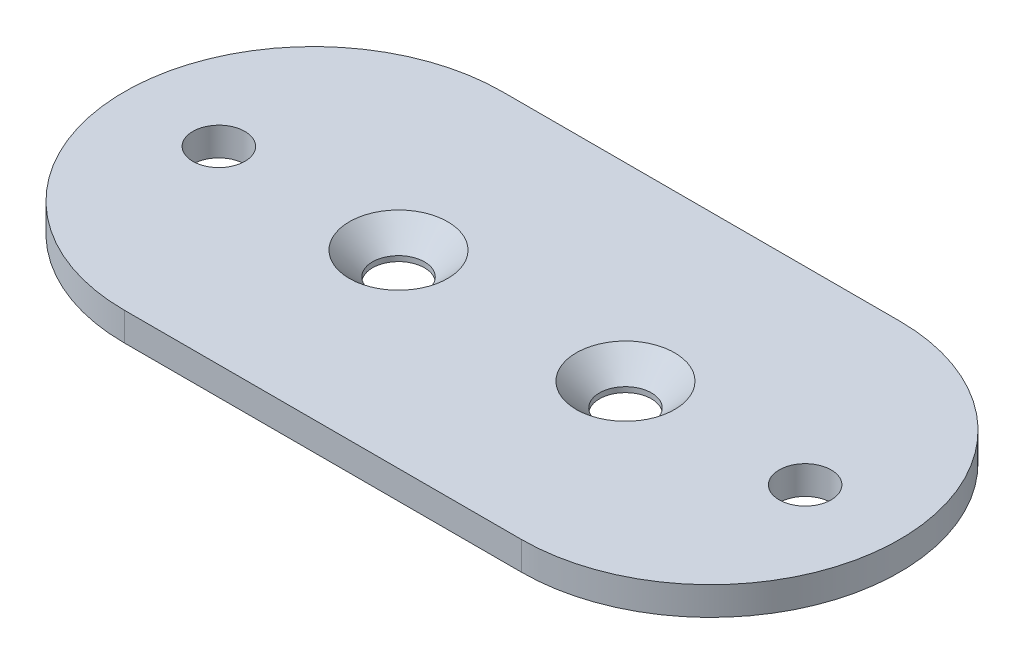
ISO-10303-21;
HEADER;
FILE_DESCRIPTION(('STEP AP214'),'2;1');
FILE_NAME('part.step','',(''),(''),'','','');
FILE_SCHEMA(('AUTOMOTIVE_DESIGN { 1 0 10303 214 1 1 1 1 }'));
ENDSEC;
DATA;
#1=APPLICATION_CONTEXT('core data for automotive mechanical design processes');
#2=APPLICATION_PROTOCOL_DEFINITION('international standard','automotive_design',2000,#1);
#3=PRODUCT_CONTEXT('',#1,'mechanical');
#4=PRODUCT('Part','Part','',(#3));
#5=PRODUCT_RELATED_PRODUCT_CATEGORY('part','',(#4));
#6=PRODUCT_DEFINITION_FORMATION('','',#4);
#7=PRODUCT_DEFINITION_CONTEXT('part definition',#1,'design');
#8=PRODUCT_DEFINITION('design','',#6,#7);
#9=PRODUCT_DEFINITION_SHAPE('','',#8);
#10=(LENGTH_UNIT() NAMED_UNIT(*) SI_UNIT(.MILLI.,.METRE.));
#11=(NAMED_UNIT(*) PLANE_ANGLE_UNIT() SI_UNIT($,.RADIAN.));
#12=(NAMED_UNIT(*) SI_UNIT($,.STERADIAN.) SOLID_ANGLE_UNIT());
#13=UNCERTAINTY_MEASURE_WITH_UNIT(LENGTH_MEASURE(1.E-05),#10,'distance_accuracy_value','');
#14=(GEOMETRIC_REPRESENTATION_CONTEXT(3) GLOBAL_UNCERTAINTY_ASSIGNED_CONTEXT((#13)) GLOBAL_UNIT_ASSIGNED_CONTEXT((#10,
#11,#12)) REPRESENTATION_CONTEXT('',''));
#15=CARTESIAN_POINT('',(0.,0.,0.));
#16=DIRECTION('',(0.,0.,1.));
#17=DIRECTION('',(1.,0.,0.));
#18=AXIS2_PLACEMENT_3D('',#15,#16,#17);
#19=CARTESIAN_POINT('',(0.,3.,0.));
#20=DIRECTION('',(0.,1.,0.));
#21=DIRECTION('',(0.,0.,1.));
#22=AXIS2_PLACEMENT_3D('',#19,#20,#21);
#23=PLANE('',#22);
#24=CARTESIAN_POINT('',(33.,3.,0.));
#25=DIRECTION('',(0.,1.,0.));
#26=DIRECTION('',(0.,0.,1.));
#27=AXIS2_PLACEMENT_3D('',#24,#25,#26);
#28=CIRCLE('',#27,5.2);
#29=CARTESIAN_POINT('',(33.,3.,5.2));
#30=VERTEX_POINT('',#29);
#31=EDGE_CURVE('E138',#30,#30,#28,.T.);
#32=ORIENTED_EDGE('',*,*,#31,.F.);
#33=EDGE_LOOP('',(#32));
#34=FACE_BOUND('',#33,.T.);
#35=CARTESIAN_POINT('',(9.,3.,0.));
#36=DIRECTION('',(0.,1.,0.));
#37=DIRECTION('',(0.,0.,1.));
#38=AXIS2_PLACEMENT_3D('',#35,#36,#37);
#39=CIRCLE('',#38,5.2);
#40=CARTESIAN_POINT('',(9.,3.,5.2));
#41=VERTEX_POINT('',#40);
#42=EDGE_CURVE('E129',#41,#41,#39,.T.);
#43=ORIENTED_EDGE('',*,*,#42,.F.);
#44=EDGE_LOOP('',(#43));
#45=FACE_BOUND('',#44,.T.);
#46=CARTESIAN_POINT('',(-10.,3.,0.));
#47=DIRECTION('',(0.,1.,0.));
#48=DIRECTION('',(0.,0.,1.));
#49=AXIS2_PLACEMENT_3D('',#46,#47,#48);
#50=CIRCLE('',#49,2.75);
#51=CARTESIAN_POINT('',(-10.,3.,2.75));
#52=VERTEX_POINT('',#51);
#53=EDGE_CURVE('E100',#52,#52,#50,.T.);
#54=ORIENTED_EDGE('',*,*,#53,.F.);
#55=EDGE_LOOP('',(#54));
#56=FACE_BOUND('',#55,.T.);
#57=CARTESIAN_POINT('',(0.,3.,0.));
#58=DIRECTION('',(0.,1.,0.));
#59=DIRECTION('',(0.,0.,1.));
#60=AXIS2_PLACEMENT_3D('',#57,#58,#59);
#61=CIRCLE('',#60,20.);
#62=CARTESIAN_POINT('',(0.,3.,-20.));
#63=VERTEX_POINT('',#62);
#64=CARTESIAN_POINT('',(0.,3.,20.));
#65=VERTEX_POINT('',#64);
#66=EDGE_CURVE('E85',#63,#65,#61,.T.);
#67=ORIENTED_EDGE('',*,*,#66,.T.);
#68=DIRECTION('',(1.,0.,0.));
#69=VECTOR('',#68,1.);
#70=CARTESIAN_POINT('',(0.,3.,20.));
#71=LINE('',#70,#69);
#72=CARTESIAN_POINT('',(42.,3.,20.));
#73=VERTEX_POINT('',#72);
#74=EDGE_CURVE('E80',#65,#73,#71,.T.);
#75=ORIENTED_EDGE('',*,*,#74,.T.);
#76=CARTESIAN_POINT('',(42.,3.,0.));
#77=DIRECTION('',(0.,1.,0.));
#78=DIRECTION('',(0.,0.,1.));
#79=AXIS2_PLACEMENT_3D('',#76,#77,#78);
#80=CIRCLE('',#79,20.);
#81=CARTESIAN_POINT('',(42.,3.,-20.));
#82=VERTEX_POINT('',#81);
#83=EDGE_CURVE('E83',#73,#82,#80,.T.);
#84=ORIENTED_EDGE('',*,*,#83,.T.);
#85=DIRECTION('',(-1.,0.,0.));
#86=VECTOR('',#85,1.);
#87=CARTESIAN_POINT('',(0.,3.,-20.));
#88=LINE('',#87,#86);
#89=EDGE_CURVE('E50',#82,#63,#88,.T.);
#90=ORIENTED_EDGE('',*,*,#89,.T.);
#91=EDGE_LOOP('',(#67,#75,#84,#90));
#92=FACE_BOUND('',#91,.T.);
#93=CARTESIAN_POINT('',(52.,3.,0.));
#94=DIRECTION('',(0.,1.,0.));
#95=DIRECTION('',(0.,0.,1.));
#96=AXIS2_PLACEMENT_3D('',#93,#94,#95);
#97=CIRCLE('',#96,2.75);
#98=CARTESIAN_POINT('',(52.,3.,2.75));
#99=VERTEX_POINT('',#98);
#100=EDGE_CURVE('E115',#99,#99,#97,.T.);
#101=ORIENTED_EDGE('',*,*,#100,.F.);
#102=EDGE_LOOP('',(#101));
#103=FACE_BOUND('',#102,.T.);
#104=ADVANCED_FACE('F33',(#34,#45,#56,#92,#103),#23,.T.);
#105=CARTESIAN_POINT('',(0.,0.,0.));
#106=DIRECTION('',(0.,1.,0.));
#107=DIRECTION('',(0.,0.,1.));
#108=AXIS2_PLACEMENT_3D('',#105,#106,#107);
#109=PLANE('',#108);
#110=CARTESIAN_POINT('',(33.,0.,0.));
#111=DIRECTION('',(0.,1.,0.));
#112=DIRECTION('',(0.,0.,1.));
#113=AXIS2_PLACEMENT_3D('',#110,#111,#112);
#114=CIRCLE('',#113,2.74999999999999);
#115=CARTESIAN_POINT('',(33.,0.,2.74999999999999));
#116=VERTEX_POINT('',#115);
#117=EDGE_CURVE('E132',#116,#116,#114,.T.);
#118=ORIENTED_EDGE('',*,*,#117,.T.);
#119=EDGE_LOOP('',(#118));
#120=FACE_BOUND('',#119,.T.);
#121=CARTESIAN_POINT('',(9.,0.,0.));
#122=DIRECTION('',(0.,1.,0.));
#123=DIRECTION('',(0.,0.,1.));
#124=AXIS2_PLACEMENT_3D('',#121,#122,#123);
#125=CIRCLE('',#124,2.74999999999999);
#126=CARTESIAN_POINT('',(9.,0.,2.74999999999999));
#127=VERTEX_POINT('',#126);
#128=EDGE_CURVE('E121',#127,#127,#125,.T.);
#129=ORIENTED_EDGE('',*,*,#128,.T.);
#130=EDGE_LOOP('',(#129));
#131=FACE_BOUND('',#130,.T.);
#132=CARTESIAN_POINT('',(0.,0.,0.));
#133=DIRECTION('',(0.,1.,0.));
#134=DIRECTION('',(0.,0.,1.));
#135=AXIS2_PLACEMENT_3D('',#132,#133,#134);
#136=CIRCLE('',#135,20.);
#137=CARTESIAN_POINT('',(0.,0.,-20.));
#138=VERTEX_POINT('',#137);
#139=CARTESIAN_POINT('',(0.,0.,20.));
#140=VERTEX_POINT('',#139);
#141=EDGE_CURVE('E97',#138,#140,#136,.T.);
#142=ORIENTED_EDGE('',*,*,#141,.F.);
#143=DIRECTION('',(-1.,0.,0.));
#144=VECTOR('',#143,1.);
#145=CARTESIAN_POINT('',(0.,0.,-20.));
#146=LINE('',#145,#144);
#147=CARTESIAN_POINT('',(42.,0.,-20.));
#148=VERTEX_POINT('',#147);
#149=EDGE_CURVE('E73',#148,#138,#146,.T.);
#150=ORIENTED_EDGE('',*,*,#149,.F.);
#151=CARTESIAN_POINT('',(42.,0.,0.));
#152=DIRECTION('',(0.,1.,0.));
#153=DIRECTION('',(0.,0.,1.));
#154=AXIS2_PLACEMENT_3D('',#151,#152,#153);
#155=CIRCLE('',#154,20.);
#156=CARTESIAN_POINT('',(42.,0.,20.));
#157=VERTEX_POINT('',#156);
#158=EDGE_CURVE('E67',#157,#148,#155,.T.);
#159=ORIENTED_EDGE('',*,*,#158,.F.);
#160=DIRECTION('',(1.,0.,0.));
#161=VECTOR('',#160,1.);
#162=CARTESIAN_POINT('',(0.,0.,20.));
#163=LINE('',#162,#161);
#164=EDGE_CURVE('E89',#140,#157,#163,.T.);
#165=ORIENTED_EDGE('',*,*,#164,.F.);
#166=EDGE_LOOP('',(#142,#150,#159,#165));
#167=FACE_BOUND('',#166,.T.);
#168=CARTESIAN_POINT('',(-10.,0.,0.));
#169=DIRECTION('',(0.,1.,0.));
#170=DIRECTION('',(0.,0.,1.));
#171=AXIS2_PLACEMENT_3D('',#168,#169,#170);
#172=CIRCLE('',#171,2.75);
#173=CARTESIAN_POINT('',(-10.,0.,2.75));
#174=VERTEX_POINT('',#173);
#175=EDGE_CURVE('E112',#174,#174,#172,.T.);
#176=ORIENTED_EDGE('',*,*,#175,.T.);
#177=EDGE_LOOP('',(#176));
#178=FACE_BOUND('',#177,.T.);
#179=CARTESIAN_POINT('',(52.,0.,0.));
#180=DIRECTION('',(0.,1.,0.));
#181=DIRECTION('',(0.,0.,1.));
#182=AXIS2_PLACEMENT_3D('',#179,#180,#181);
#183=CIRCLE('',#182,2.75);
#184=CARTESIAN_POINT('',(52.,0.,2.75));
#185=VERTEX_POINT('',#184);
#186=EDGE_CURVE('E118',#185,#185,#183,.T.);
#187=ORIENTED_EDGE('',*,*,#186,.T.);
#188=EDGE_LOOP('',(#187));
#189=FACE_BOUND('',#188,.T.);
#190=ADVANCED_FACE('F108',(#120,#131,#167,#178,#189),#109,.F.);
#191=CARTESIAN_POINT('',(0.,3.,0.));
#192=DIRECTION('',(0.,-1.,0.));
#193=DIRECTION('',(0.,0.,-1.));
#194=AXIS2_PLACEMENT_3D('',#191,#192,#193);
#195=CYLINDRICAL_SURFACE('',#194,20.);
#196=ORIENTED_EDGE('',*,*,#141,.T.);
#197=DIRECTION('',(0.,-1.,0.));
#198=VECTOR('',#197,1.);
#199=CARTESIAN_POINT('',(0.,3.,20.));
#200=LINE('',#199,#198);
#201=EDGE_CURVE('E11',#65,#140,#200,.T.);
#202=ORIENTED_EDGE('',*,*,#201,.F.);
#203=ORIENTED_EDGE('',*,*,#66,.F.);
#204=DIRECTION('',(0.,-1.,0.));
#205=VECTOR('',#204,1.);
#206=CARTESIAN_POINT('',(0.,3.,-20.));
#207=LINE('',#206,#205);
#208=EDGE_CURVE('E93',#63,#138,#207,.T.);
#209=ORIENTED_EDGE('',*,*,#208,.T.);
#210=EDGE_LOOP('',(#196,#202,#203,#209));
#211=FACE_BOUND('',#210,.T.);
#212=ADVANCED_FACE('F35',(#211),#195,.T.);
#213=CARTESIAN_POINT('',(0.,3.,20.));
#214=DIRECTION('',(0.,0.,-1.));
#215=DIRECTION('',(-1.,0.,0.));
#216=AXIS2_PLACEMENT_3D('',#213,#214,#215);
#217=PLANE('',#216);
#218=ORIENTED_EDGE('',*,*,#164,.T.);
#219=DIRECTION('',(0.,-1.,0.));
#220=VECTOR('',#219,1.);
#221=CARTESIAN_POINT('',(42.,3.,20.));
#222=LINE('',#221,#220);
#223=EDGE_CURVE('E42',#73,#157,#222,.T.);
#224=ORIENTED_EDGE('',*,*,#223,.F.);
#225=ORIENTED_EDGE('',*,*,#74,.F.);
#226=ORIENTED_EDGE('',*,*,#201,.T.);
#227=EDGE_LOOP('',(#218,#224,#225,#226));
#228=FACE_BOUND('',#227,.T.);
#229=ADVANCED_FACE('F88',(#228),#217,.F.);
#230=CARTESIAN_POINT('',(42.,3.,0.));
#231=DIRECTION('',(0.,-1.,0.));
#232=DIRECTION('',(0.,0.,-1.));
#233=AXIS2_PLACEMENT_3D('',#230,#231,#232);
#234=CYLINDRICAL_SURFACE('',#233,20.);
#235=ORIENTED_EDGE('',*,*,#158,.T.);
#236=DIRECTION('',(0.,-1.,0.));
#237=VECTOR('',#236,1.);
#238=CARTESIAN_POINT('',(42.,3.,-20.));
#239=LINE('',#238,#237);
#240=EDGE_CURVE('E90',#82,#148,#239,.T.);
#241=ORIENTED_EDGE('',*,*,#240,.F.);
#242=ORIENTED_EDGE('',*,*,#83,.F.);
#243=ORIENTED_EDGE('',*,*,#223,.T.);
#244=EDGE_LOOP('',(#235,#241,#242,#243));
#245=FACE_BOUND('',#244,.T.);
#246=ADVANCED_FACE('F91',(#245),#234,.T.);
#247=CARTESIAN_POINT('',(0.,3.,-20.));
#248=DIRECTION('',(0.,0.,1.));
#249=DIRECTION('',(1.,0.,0.));
#250=AXIS2_PLACEMENT_3D('',#247,#248,#249);
#251=PLANE('',#250);
#252=ORIENTED_EDGE('',*,*,#149,.T.);
#253=ORIENTED_EDGE('',*,*,#208,.F.);
#254=ORIENTED_EDGE('',*,*,#89,.F.);
#255=ORIENTED_EDGE('',*,*,#240,.T.);
#256=EDGE_LOOP('',(#252,#253,#254,#255));
#257=FACE_BOUND('',#256,.T.);
#258=ADVANCED_FACE('F105',(#257),#251,.F.);
#259=CARTESIAN_POINT('',(-10.,3.,0.));
#260=DIRECTION('',(0.,-1.,0.));
#261=DIRECTION('',(0.,0.,-1.));
#262=AXIS2_PLACEMENT_3D('',#259,#260,#261);
#263=CYLINDRICAL_SURFACE('',#262,2.75);
#264=ORIENTED_EDGE('',*,*,#53,.T.);
#265=EDGE_LOOP('',(#264));
#266=FACE_BOUND('',#265,.T.);
#267=ORIENTED_EDGE('',*,*,#175,.F.);
#268=EDGE_LOOP('',(#267));
#269=FACE_BOUND('',#268,.T.);
#270=ADVANCED_FACE('F151',(#266,#269),#263,.F.);
#271=CARTESIAN_POINT('',(52.,3.,0.));
#272=DIRECTION('',(0.,-1.,0.));
#273=DIRECTION('',(0.,0.,-1.));
#274=AXIS2_PLACEMENT_3D('',#271,#272,#273);
#275=CYLINDRICAL_SURFACE('',#274,2.75);
#276=ORIENTED_EDGE('',*,*,#100,.T.);
#277=EDGE_LOOP('',(#276));
#278=FACE_BOUND('',#277,.T.);
#279=ORIENTED_EDGE('',*,*,#186,.F.);
#280=EDGE_LOOP('',(#279));
#281=FACE_BOUND('',#280,.T.);
#282=ADVANCED_FACE('F154',(#278,#281),#275,.F.);
#283=CARTESIAN_POINT('',(9.,3.,0.));
#284=DIRECTION('',(0.,1.,0.));
#285=DIRECTION('',(0.,0.,1.));
#286=AXIS2_PLACEMENT_3D('',#283,#284,#285);
#287=CYLINDRICAL_SURFACE('',#286,2.74999999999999);
#288=ORIENTED_EDGE('',*,*,#128,.F.);
#289=EDGE_LOOP('',(#288));
#290=FACE_BOUND('',#289,.T.);
#291=CARTESIAN_POINT('',(9.,0.549999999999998,0.));
#292=DIRECTION('',(0.,1.,0.));
#293=DIRECTION('',(0.,0.,1.));
#294=AXIS2_PLACEMENT_3D('',#291,#292,#293);
#295=CIRCLE('',#294,2.75);
#296=CARTESIAN_POINT('',(9.,0.549999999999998,2.75));
#297=VERTEX_POINT('',#296);
#298=EDGE_CURVE('E126',#297,#297,#295,.T.);
#299=ORIENTED_EDGE('',*,*,#298,.T.);
#300=EDGE_LOOP('',(#299));
#301=FACE_BOUND('',#300,.T.);
#302=ADVANCED_FACE('F164',(#290,#301),#287,.F.);
#303=CARTESIAN_POINT('',(9.,3.,0.));
#304=DIRECTION('',(0.,1.,0.));
#305=DIRECTION('',(0.,0.,1.));
#306=AXIS2_PLACEMENT_3D('',#303,#304,#305);
#307=CONICAL_SURFACE('',#306,5.2,0.785398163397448);
#308=ORIENTED_EDGE('',*,*,#298,.F.);
#309=EDGE_LOOP('',(#308));
#310=FACE_BOUND('',#309,.T.);
#311=ORIENTED_EDGE('',*,*,#42,.T.);
#312=EDGE_LOOP('',(#311));
#313=FACE_BOUND('',#312,.T.);
#314=ADVANCED_FACE('F170',(#310,#313),#307,.F.);
#315=CARTESIAN_POINT('',(33.,3.,0.));
#316=DIRECTION('',(0.,1.,0.));
#317=DIRECTION('',(0.,0.,1.));
#318=AXIS2_PLACEMENT_3D('',#315,#316,#317);
#319=CYLINDRICAL_SURFACE('',#318,2.75);
#320=ORIENTED_EDGE('',*,*,#117,.F.);
#321=EDGE_LOOP('',(#320));
#322=FACE_BOUND('',#321,.T.);
#323=CARTESIAN_POINT('',(33.,0.549999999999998,0.));
#324=DIRECTION('',(0.,1.,0.));
#325=DIRECTION('',(0.,0.,1.));
#326=AXIS2_PLACEMENT_3D('',#323,#324,#325);
#327=CIRCLE('',#326,2.75);
#328=CARTESIAN_POINT('',(33.,0.549999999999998,2.75));
#329=VERTEX_POINT('',#328);
#330=EDGE_CURVE('E135',#329,#329,#327,.T.);
#331=ORIENTED_EDGE('',*,*,#330,.T.);
#332=EDGE_LOOP('',(#331));
#333=FACE_BOUND('',#332,.T.);
#334=ADVANCED_FACE('F237',(#322,#333),#319,.F.);
#335=CARTESIAN_POINT('',(33.,3.,0.));
#336=DIRECTION('',(0.,1.,0.));
#337=DIRECTION('',(0.,0.,1.));
#338=AXIS2_PLACEMENT_3D('',#335,#336,#337);
#339=CONICAL_SURFACE('',#338,5.2,0.785398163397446);
#340=ORIENTED_EDGE('',*,*,#330,.F.);
#341=EDGE_LOOP('',(#340));
#342=FACE_BOUND('',#341,.T.);
#343=ORIENTED_EDGE('',*,*,#31,.T.);
#344=EDGE_LOOP('',(#343));
#345=FACE_BOUND('',#344,.T.);
#346=ADVANCED_FACE('F142',(#342,#345),#339,.F.);
#347=CLOSED_SHELL('',(#104,#190,#212,#229,#246,#258,#270,#282,#302,#314,#334,#346));
#348=MANIFOLD_SOLID_BREP('B2',#347);
#349=ADVANCED_BREP_SHAPE_REPRESENTATION('',(#18,#348),#14);
#350=SHAPE_DEFINITION_REPRESENTATION(#9,#349);
ENDSEC;
END-ISO-10303-21;
